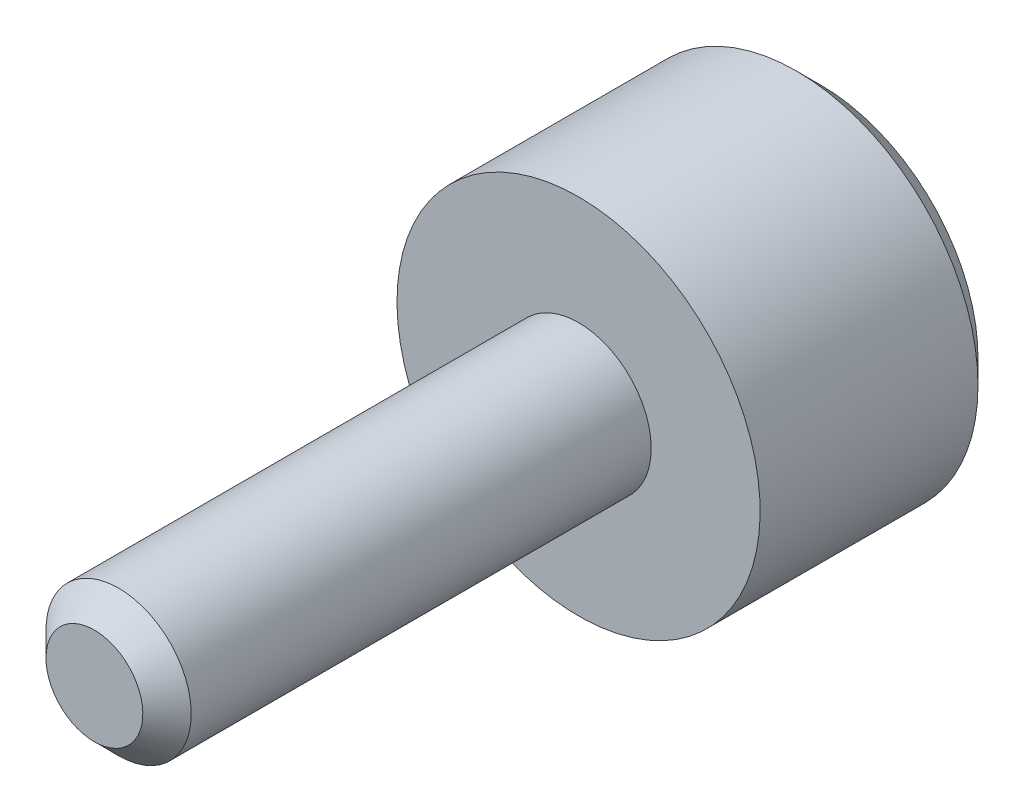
ISO-10303-21;
HEADER;
FILE_DESCRIPTION(('STEP AP214'),'2;1');
FILE_NAME('part.step','',(''),(''),'','','');
FILE_SCHEMA(('AUTOMOTIVE_DESIGN { 1 0 10303 214 1 1 1 1 }'));
ENDSEC;
DATA;
#1=APPLICATION_CONTEXT('core data for automotive mechanical design processes');
#2=APPLICATION_PROTOCOL_DEFINITION('international standard','automotive_design',2000,#1);
#3=PRODUCT_CONTEXT('',#1,'mechanical');
#4=PRODUCT('Part','Part','',(#3));
#5=PRODUCT_RELATED_PRODUCT_CATEGORY('part','',(#4));
#6=PRODUCT_DEFINITION_FORMATION('','',#4);
#7=PRODUCT_DEFINITION_CONTEXT('part definition',#1,'design');
#8=PRODUCT_DEFINITION('design','',#6,#7);
#9=PRODUCT_DEFINITION_SHAPE('','',#8);
#10=(LENGTH_UNIT() NAMED_UNIT(*) SI_UNIT(.MILLI.,.METRE.));
#11=(NAMED_UNIT(*) PLANE_ANGLE_UNIT() SI_UNIT($,.RADIAN.));
#12=(NAMED_UNIT(*) SI_UNIT($,.STERADIAN.) SOLID_ANGLE_UNIT());
#13=UNCERTAINTY_MEASURE_WITH_UNIT(LENGTH_MEASURE(1.E-05),#10,'distance_accuracy_value','');
#14=(GEOMETRIC_REPRESENTATION_CONTEXT(3) GLOBAL_UNCERTAINTY_ASSIGNED_CONTEXT((#13)) GLOBAL_UNIT_ASSIGNED_CONTEXT((#10,
#11,#12)) REPRESENTATION_CONTEXT('',''));
#15=CARTESIAN_POINT('',(0.,0.,0.));
#16=DIRECTION('',(0.,0.,1.));
#17=DIRECTION('',(1.,0.,0.));
#18=AXIS2_PLACEMENT_3D('',#15,#16,#17);
#19=CARTESIAN_POINT('',(4.3301270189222,2.5,10.));
#20=DIRECTION('',(0.,0.,-1.));
#21=DIRECTION('',(-0.5,0.866025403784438,0.));
#22=AXIS2_PLACEMENT_3D('',#19,#20,#21);
#23=PLANE('',#22);
#24=CARTESIAN_POINT('',(0.,0.,10.));
#25=DIRECTION('',(0.,0.,-1.));
#26=DIRECTION('',(-0.5,0.866025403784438,0.));
#27=AXIS2_PLACEMENT_3D('',#24,#25,#26);
#28=CIRCLE('',#27,7.5);
#29=CARTESIAN_POINT('',(-3.75,6.49519052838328,10.));
#30=VERTEX_POINT('',#29);
#31=EDGE_CURVE('E83',#30,#30,#28,.T.);
#32=ORIENTED_EDGE('',*,*,#31,.F.);
#33=EDGE_LOOP('',(#32));
#34=FACE_BOUND('',#33,.T.);
#35=CARTESIAN_POINT('',(0.,0.,10.));
#36=DIRECTION('',(0.,0.,-1.));
#37=DIRECTION('',(-0.5,0.866025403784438,0.));
#38=AXIS2_PLACEMENT_3D('',#35,#36,#37);
#39=CIRCLE('',#38,3.);
#40=CARTESIAN_POINT('',(-1.5,2.59807621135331,10.));
#41=VERTEX_POINT('',#40);
#42=EDGE_CURVE('E80',#41,#41,#39,.T.);
#43=ORIENTED_EDGE('',*,*,#42,.T.);
#44=EDGE_LOOP('',(#43));
#45=FACE_BOUND('',#44,.T.);
#46=ADVANCED_FACE('F14',(#34,#45),#23,.F.);
#47=CARTESIAN_POINT('',(0.,0.,0.));
#48=DIRECTION('',(0.,0.,1.));
#49=DIRECTION('',(0.5,-0.866025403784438,0.));
#50=AXIS2_PLACEMENT_3D('',#47,#48,#49);
#51=PLANE('',#50);
#52=CARTESIAN_POINT('',(0.,0.,0.));
#53=DIRECTION('',(0.,0.,-1.));
#54=DIRECTION('',(-1.,0.,0.));
#55=AXIS2_PLACEMENT_3D('',#52,#53,#54);
#56=CIRCLE('',#55,3.);
#57=CARTESIAN_POINT('',(-3.,0.,0.));
#58=VERTEX_POINT('',#57);
#59=EDGE_CURVE('E305',#58,#58,#56,.T.);
#60=ORIENTED_EDGE('',*,*,#59,.F.);
#61=EDGE_LOOP('',(#60));
#62=FACE_BOUND('',#61,.T.);
#63=CARTESIAN_POINT('',(0.,0.,0.));
#64=DIRECTION('',(0.,0.,1.));
#65=DIRECTION('',(0.5,-0.866025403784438,0.));
#66=AXIS2_PLACEMENT_3D('',#63,#64,#65);
#67=CIRCLE('',#66,6.5);
#68=CARTESIAN_POINT('',(3.25,-5.62916512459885,0.));
#69=VERTEX_POINT('',#68);
#70=EDGE_CURVE('E263',#69,#69,#67,.F.);
#71=ORIENTED_EDGE('',*,*,#70,.T.);
#72=EDGE_LOOP('',(#71));
#73=FACE_BOUND('',#72,.T.);
#74=ADVANCED_FACE('F107',(#62,#73),#51,.F.);
#75=CARTESIAN_POINT('',(0.,0.,0.));
#76=DIRECTION('',(0.,0.,-1.));
#77=DIRECTION('',(-0.5,0.866025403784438,0.));
#78=AXIS2_PLACEMENT_3D('',#75,#76,#77);
#79=CYLINDRICAL_SURFACE('',#78,7.5);
#80=CARTESIAN_POINT('',(0.,0.,1.));
#81=DIRECTION('',(0.,0.,1.));
#82=DIRECTION('',(0.5,-0.866025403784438,0.));
#83=AXIS2_PLACEMENT_3D('',#80,#81,#82);
#84=CIRCLE('',#83,7.5);
#85=CARTESIAN_POINT('',(3.75,-6.49519052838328,1.));
#86=VERTEX_POINT('',#85);
#87=EDGE_CURVE('E91',#86,#86,#84,.T.);
#88=ORIENTED_EDGE('',*,*,#87,.T.);
#89=EDGE_LOOP('',(#88));
#90=FACE_BOUND('',#89,.T.);
#91=ORIENTED_EDGE('',*,*,#31,.T.);
#92=EDGE_LOOP('',(#91));
#93=FACE_BOUND('',#92,.T.);
#94=ADVANCED_FACE('F115',(#90,#93),#79,.T.);
#95=CARTESIAN_POINT('',(0.,0.,0.));
#96=DIRECTION('',(0.,0.,1.));
#97=DIRECTION('',(0.5,-0.866025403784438,0.));
#98=AXIS2_PLACEMENT_3D('',#95,#96,#97);
#99=CONICAL_SURFACE('',#98,6.5,0.785398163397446);
#100=ORIENTED_EDGE('',*,*,#87,.F.);
#101=EDGE_LOOP('',(#100));
#102=FACE_BOUND('',#101,.T.);
#103=ORIENTED_EDGE('',*,*,#70,.F.);
#104=EDGE_LOOP('',(#103));
#105=FACE_BOUND('',#104,.T.);
#106=ADVANCED_FACE('F121',(#102,#105),#99,.T.);
#107=CARTESIAN_POINT('',(-1.5,2.59807621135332,30.));
#108=DIRECTION('',(0.,0.,1.));
#109=DIRECTION('',(0.5,-0.866025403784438,0.));
#110=AXIS2_PLACEMENT_3D('',#107,#108,#109);
#111=PLANE('',#110);
#112=CARTESIAN_POINT('',(0.,0.,30.));
#113=DIRECTION('',(0.,0.,1.));
#114=DIRECTION('',(0.866025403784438,0.5,0.));
#115=AXIS2_PLACEMENT_3D('',#112,#113,#114);
#116=CIRCLE('',#115,2.);
#117=CARTESIAN_POINT('',(1.73205080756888,1.,30.));
#118=VERTEX_POINT('',#117);
#119=EDGE_CURVE('E22',#118,#118,#116,.T.);
#120=ORIENTED_EDGE('',*,*,#119,.T.);
#121=EDGE_LOOP('',(#120));
#122=FACE_BOUND('',#121,.T.);
#123=ADVANCED_FACE('F95',(#122),#111,.T.);
#124=CARTESIAN_POINT('',(0.,0.,10.));
#125=DIRECTION('',(0.,0.,-1.));
#126=DIRECTION('',(-0.5,0.866025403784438,0.));
#127=AXIS2_PLACEMENT_3D('',#124,#125,#126);
#128=CYLINDRICAL_SURFACE('',#127,3.);
#129=CARTESIAN_POINT('',(0.,0.,29.));
#130=DIRECTION('',(0.,0.,1.));
#131=DIRECTION('',(0.866025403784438,0.5,0.));
#132=AXIS2_PLACEMENT_3D('',#129,#130,#131);
#133=CIRCLE('',#132,3.);
#134=CARTESIAN_POINT('',(2.59807621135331,1.5,29.));
#135=VERTEX_POINT('',#134);
#136=EDGE_CURVE('E89',#135,#135,#133,.F.);
#137=ORIENTED_EDGE('',*,*,#136,.T.);
#138=EDGE_LOOP('',(#137));
#139=FACE_BOUND('',#138,.T.);
#140=ORIENTED_EDGE('',*,*,#42,.F.);
#141=EDGE_LOOP('',(#140));
#142=FACE_BOUND('',#141,.T.);
#143=ADVANCED_FACE('F99',(#139,#142),#128,.T.);
#144=CARTESIAN_POINT('',(0.,0.,29.));
#145=DIRECTION('',(0.,0.,-1.));
#146=DIRECTION('',(-0.866025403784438,-0.5,0.));
#147=AXIS2_PLACEMENT_3D('',#144,#145,#146);
#148=CONICAL_SURFACE('',#147,3.,0.785398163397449);
#149=ORIENTED_EDGE('',*,*,#119,.F.);
#150=EDGE_LOOP('',(#149));
#151=FACE_BOUND('',#150,.T.);
#152=ORIENTED_EDGE('',*,*,#136,.F.);
#153=EDGE_LOOP('',(#152));
#154=FACE_BOUND('',#153,.T.);
#155=ADVANCED_FACE('F16',(#151,#154),#148,.T.);
#156=CARTESIAN_POINT('',(0.,0.,4.));
#157=DIRECTION('',(0.,0.,-1.));
#158=DIRECTION('',(-1.,0.,0.));
#159=AXIS2_PLACEMENT_3D('',#156,#157,#158);
#160=PLANE('',#159);
#161=CARTESIAN_POINT('',(0.,0.,4.));
#162=DIRECTION('',(0.,0.,-1.));
#163=DIRECTION('',(-1.,0.,0.));
#164=AXIS2_PLACEMENT_3D('',#161,#162,#163);
#165=CIRCLE('',#164,3.);
#166=CARTESIAN_POINT('',(-3.,0.,4.));
#167=VERTEX_POINT('',#166);
#168=EDGE_CURVE('E74',#167,#167,#165,.T.);
#169=ORIENTED_EDGE('',*,*,#168,.T.);
#170=EDGE_LOOP('',(#169));
#171=FACE_BOUND('',#170,.T.);
#172=DIRECTION('',(0.866025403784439,0.5,0.));
#173=VECTOR('',#172,1.);
#174=CARTESIAN_POINT('',(2.5,-1.44337567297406,4.));
#175=LINE('',#174,#173);
#176=CARTESIAN_POINT('',(0.,-2.88675134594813,4.));
#177=VERTEX_POINT('',#176);
#178=CARTESIAN_POINT('',(2.5,-1.44337567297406,4.));
#179=VERTEX_POINT('',#178);
#180=EDGE_CURVE('E291',#177,#179,#175,.T.);
#181=ORIENTED_EDGE('',*,*,#180,.T.);
#182=DIRECTION('',(0.,1.,0.));
#183=VECTOR('',#182,1.);
#184=CARTESIAN_POINT('',(2.5,1.44337567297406,4.));
#185=LINE('',#184,#183);
#186=CARTESIAN_POINT('',(2.5,1.44337567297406,4.));
#187=VERTEX_POINT('',#186);
#188=EDGE_CURVE('E29',#179,#187,#185,.T.);
#189=ORIENTED_EDGE('',*,*,#188,.T.);
#190=DIRECTION('',(0.866025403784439,-0.5,0.));
#191=VECTOR('',#190,1.);
#192=CARTESIAN_POINT('',(2.5,1.44337567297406,4.));
#193=LINE('',#192,#191);
#194=CARTESIAN_POINT('',(0.,2.88675134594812,4.));
#195=VERTEX_POINT('',#194);
#196=EDGE_CURVE('E9',#195,#187,#193,.T.);
#197=ORIENTED_EDGE('',*,*,#196,.F.);
#198=DIRECTION('',(-0.866025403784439,-0.5,0.));
#199=VECTOR('',#198,1.);
#200=CARTESIAN_POINT('',(-2.5,1.44337567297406,4.));
#201=LINE('',#200,#199);
#202=CARTESIAN_POINT('',(-2.5,1.44337567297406,4.));
#203=VERTEX_POINT('',#202);
#204=EDGE_CURVE('E66',#195,#203,#201,.T.);
#205=ORIENTED_EDGE('',*,*,#204,.T.);
#206=DIRECTION('',(0.,-1.,0.));
#207=VECTOR('',#206,1.);
#208=CARTESIAN_POINT('',(-2.5,-1.44337567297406,4.));
#209=LINE('',#208,#207);
#210=CARTESIAN_POINT('',(-2.5,-1.44337567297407,4.));
#211=VERTEX_POINT('',#210);
#212=EDGE_CURVE('E73',#203,#211,#209,.T.);
#213=ORIENTED_EDGE('',*,*,#212,.T.);
#214=DIRECTION('',(-0.866025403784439,0.5,0.));
#215=VECTOR('',#214,1.);
#216=CARTESIAN_POINT('',(-2.5,-1.44337567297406,4.));
#217=LINE('',#216,#215);
#218=EDGE_CURVE('E288',#177,#211,#217,.T.);
#219=ORIENTED_EDGE('',*,*,#218,.F.);
#220=EDGE_LOOP('',(#181,#189,#197,#205,#213,#219));
#221=FACE_BOUND('',#220,.T.);
#222=ADVANCED_FACE('F65',(#171,#221),#160,.T.);
#223=CARTESIAN_POINT('',(0.,0.,4.));
#224=DIRECTION('',(0.,0.,-1.));
#225=DIRECTION('',(-1.,0.,0.));
#226=AXIS2_PLACEMENT_3D('',#223,#224,#225);
#227=CYLINDRICAL_SURFACE('',#226,3.);
#228=ORIENTED_EDGE('',*,*,#168,.F.);
#229=EDGE_LOOP('',(#228));
#230=FACE_BOUND('',#229,.T.);
#231=ORIENTED_EDGE('',*,*,#59,.T.);
#232=EDGE_LOOP('',(#231));
#233=FACE_BOUND('',#232,.T.);
#234=ADVANCED_FACE('F175',(#230,#233),#227,.F.);
#235=CARTESIAN_POINT('',(5.,0.,7.8));
#236=DIRECTION('',(0.,0.,-1.));
#237=DIRECTION('',(-0.866025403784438,-0.5,0.));
#238=AXIS2_PLACEMENT_3D('',#235,#236,#237);
#239=PLANE('',#238);
#240=DIRECTION('',(0.866025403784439,-0.5,0.));
#241=VECTOR('',#240,1.);
#242=CARTESIAN_POINT('',(0.,2.88675134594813,7.8));
#243=LINE('',#242,#241);
#244=CARTESIAN_POINT('',(0.,2.88675134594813,7.8));
#245=VERTEX_POINT('',#244);
#246=CARTESIAN_POINT('',(2.5,1.44337567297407,7.8));
#247=VERTEX_POINT('',#246);
#248=EDGE_CURVE('E78',#245,#247,#243,.T.);
#249=ORIENTED_EDGE('',*,*,#248,.T.);
#250=DIRECTION('',(0.,-1.,0.));
#251=VECTOR('',#250,1.);
#252=CARTESIAN_POINT('',(2.5,1.44337567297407,7.8));
#253=LINE('',#252,#251);
#254=CARTESIAN_POINT('',(2.5,-1.44337567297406,7.8));
#255=VERTEX_POINT('',#254);
#256=EDGE_CURVE('E297',#247,#255,#253,.T.);
#257=ORIENTED_EDGE('',*,*,#256,.T.);
#258=DIRECTION('',(-0.866025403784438,-0.5,0.));
#259=VECTOR('',#258,1.);
#260=CARTESIAN_POINT('',(2.5,-1.44337567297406,7.8));
#261=LINE('',#260,#259);
#262=CARTESIAN_POINT('',(0.,-2.88675134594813,7.8));
#263=VERTEX_POINT('',#262);
#264=EDGE_CURVE('E300',#255,#263,#261,.T.);
#265=ORIENTED_EDGE('',*,*,#264,.T.);
#266=DIRECTION('',(-0.866025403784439,0.5,0.));
#267=VECTOR('',#266,1.);
#268=CARTESIAN_POINT('',(0.,-2.88675134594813,7.8));
#269=LINE('',#268,#267);
#270=CARTESIAN_POINT('',(-2.5,-1.44337567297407,7.8));
#271=VERTEX_POINT('',#270);
#272=EDGE_CURVE('E286',#263,#271,#269,.T.);
#273=ORIENTED_EDGE('',*,*,#272,.T.);
#274=DIRECTION('',(0.,1.,0.));
#275=VECTOR('',#274,1.);
#276=CARTESIAN_POINT('',(-2.5,-1.44337567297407,7.8));
#277=LINE('',#276,#275);
#278=CARTESIAN_POINT('',(-2.5,1.44337567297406,7.8));
#279=VERTEX_POINT('',#278);
#280=EDGE_CURVE('E282',#271,#279,#277,.T.);
#281=ORIENTED_EDGE('',*,*,#280,.T.);
#282=DIRECTION('',(0.866025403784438,0.5,0.));
#283=VECTOR('',#282,1.);
#284=CARTESIAN_POINT('',(-2.5,1.44337567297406,7.8));
#285=LINE('',#284,#283);
#286=EDGE_CURVE('E268',#279,#245,#285,.T.);
#287=ORIENTED_EDGE('',*,*,#286,.T.);
#288=EDGE_LOOP('',(#249,#257,#265,#273,#281,#287));
#289=FACE_BOUND('',#288,.T.);
#290=ADVANCED_FACE('F127',(#289),#239,.T.);
#291=CARTESIAN_POINT('',(2.5,1.44337567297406,7.));
#292=DIRECTION('',(-0.5,-0.86602540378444,0.));
#293=DIRECTION('',(-0.86602540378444,0.5,0.));
#294=AXIS2_PLACEMENT_3D('',#291,#292,#293);
#295=PLANE('',#294);
#296=DIRECTION('',(0.,0.,-1.));
#297=VECTOR('',#296,1.);
#298=CARTESIAN_POINT('',(0.,2.88675134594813,7.));
#299=LINE('',#298,#297);
#300=EDGE_CURVE('E36',#245,#195,#299,.T.);
#301=ORIENTED_EDGE('',*,*,#300,.T.);
#302=ORIENTED_EDGE('',*,*,#196,.T.);
#303=DIRECTION('',(0.,0.,-1.));
#304=VECTOR('',#303,1.);
#305=CARTESIAN_POINT('',(2.5,1.44337567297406,7.));
#306=LINE('',#305,#304);
#307=EDGE_CURVE('E272',#247,#187,#306,.T.);
#308=ORIENTED_EDGE('',*,*,#307,.F.);
#309=ORIENTED_EDGE('',*,*,#248,.F.);
#310=EDGE_LOOP('',(#301,#302,#308,#309));
#311=FACE_BOUND('',#310,.T.);
#312=ADVANCED_FACE('F76',(#311),#295,.T.);
#313=CARTESIAN_POINT('',(-2.5,1.44337567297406,7.));
#314=DIRECTION('',(-0.5,0.866025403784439,0.));
#315=DIRECTION('',(0.866025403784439,0.5,0.));
#316=AXIS2_PLACEMENT_3D('',#313,#314,#315);
#317=PLANE('',#316);
#318=ORIENTED_EDGE('',*,*,#204,.F.);
#319=ORIENTED_EDGE('',*,*,#300,.F.);
#320=ORIENTED_EDGE('',*,*,#286,.F.);
#321=DIRECTION('',(0.,0.,-1.));
#322=VECTOR('',#321,1.);
#323=CARTESIAN_POINT('',(-2.5,1.44337567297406,7.));
#324=LINE('',#323,#322);
#325=EDGE_CURVE('E72',#279,#203,#324,.T.);
#326=ORIENTED_EDGE('',*,*,#325,.T.);
#327=EDGE_LOOP('',(#318,#319,#320,#326));
#328=FACE_BOUND('',#327,.T.);
#329=ADVANCED_FACE('F71',(#328),#317,.F.);
#330=CARTESIAN_POINT('',(-2.5,-1.44337567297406,7.));
#331=DIRECTION('',(-1.,0.,0.));
#332=DIRECTION('',(0.,1.,0.));
#333=AXIS2_PLACEMENT_3D('',#330,#331,#332);
#334=PLANE('',#333);
#335=ORIENTED_EDGE('',*,*,#212,.F.);
#336=ORIENTED_EDGE('',*,*,#325,.F.);
#337=ORIENTED_EDGE('',*,*,#280,.F.);
#338=DIRECTION('',(0.,0.,-1.));
#339=VECTOR('',#338,1.);
#340=CARTESIAN_POINT('',(-2.5,-1.44337567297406,7.));
#341=LINE('',#340,#339);
#342=EDGE_CURVE('E85',#271,#211,#341,.T.);
#343=ORIENTED_EDGE('',*,*,#342,.T.);
#344=EDGE_LOOP('',(#335,#336,#337,#343));
#345=FACE_BOUND('',#344,.T.);
#346=ADVANCED_FACE('F139',(#345),#334,.F.);
#347=CARTESIAN_POINT('',(-2.5,-1.44337567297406,7.));
#348=DIRECTION('',(0.5,0.86602540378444,0.));
#349=DIRECTION('',(0.86602540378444,-0.5,0.));
#350=AXIS2_PLACEMENT_3D('',#347,#348,#349);
#351=PLANE('',#350);
#352=DIRECTION('',(0.,0.,-1.));
#353=VECTOR('',#352,1.);
#354=CARTESIAN_POINT('',(0.,-2.88675134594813,7.));
#355=LINE('',#354,#353);
#356=EDGE_CURVE('E277',#263,#177,#355,.T.);
#357=ORIENTED_EDGE('',*,*,#356,.T.);
#358=ORIENTED_EDGE('',*,*,#218,.T.);
#359=ORIENTED_EDGE('',*,*,#342,.F.);
#360=ORIENTED_EDGE('',*,*,#272,.F.);
#361=EDGE_LOOP('',(#357,#358,#359,#360));
#362=FACE_BOUND('',#361,.T.);
#363=ADVANCED_FACE('F132',(#362),#351,.T.);
#364=CARTESIAN_POINT('',(2.5,1.44337567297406,7.));
#365=DIRECTION('',(1.,0.,0.));
#366=DIRECTION('',(0.,-1.,0.));
#367=AXIS2_PLACEMENT_3D('',#364,#365,#366);
#368=PLANE('',#367);
#369=ORIENTED_EDGE('',*,*,#188,.F.);
#370=DIRECTION('',(0.,0.,-1.));
#371=VECTOR('',#370,1.);
#372=CARTESIAN_POINT('',(2.5,-1.44337567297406,7.));
#373=LINE('',#372,#371);
#374=EDGE_CURVE('E274',#255,#179,#373,.T.);
#375=ORIENTED_EDGE('',*,*,#374,.F.);
#376=ORIENTED_EDGE('',*,*,#256,.F.);
#377=ORIENTED_EDGE('',*,*,#307,.T.);
#378=EDGE_LOOP('',(#369,#375,#376,#377));
#379=FACE_BOUND('',#378,.T.);
#380=ADVANCED_FACE('F128',(#379),#368,.F.);
#381=CARTESIAN_POINT('',(2.5,-1.44337567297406,7.));
#382=DIRECTION('',(0.5,-0.866025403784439,0.));
#383=DIRECTION('',(-0.866025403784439,-0.5,0.));
#384=AXIS2_PLACEMENT_3D('',#381,#382,#383);
#385=PLANE('',#384);
#386=ORIENTED_EDGE('',*,*,#180,.F.);
#387=ORIENTED_EDGE('',*,*,#356,.F.);
#388=ORIENTED_EDGE('',*,*,#264,.F.);
#389=ORIENTED_EDGE('',*,*,#374,.T.);
#390=EDGE_LOOP('',(#386,#387,#388,#389));
#391=FACE_BOUND('',#390,.T.);
#392=ADVANCED_FACE('F131',(#391),#385,.F.);
#393=CLOSED_SHELL('',(#46,#74,#94,#106,#123,#143,#155,#222,#234,#290,#312,#329,#346,#363,#380,#392));
#394=MANIFOLD_SOLID_BREP('B1',#393);
#395=ADVANCED_BREP_SHAPE_REPRESENTATION('',(#18,#394),#14);
#396=SHAPE_DEFINITION_REPRESENTATION(#9,#395);
ENDSEC;
END-ISO-10303-21;
